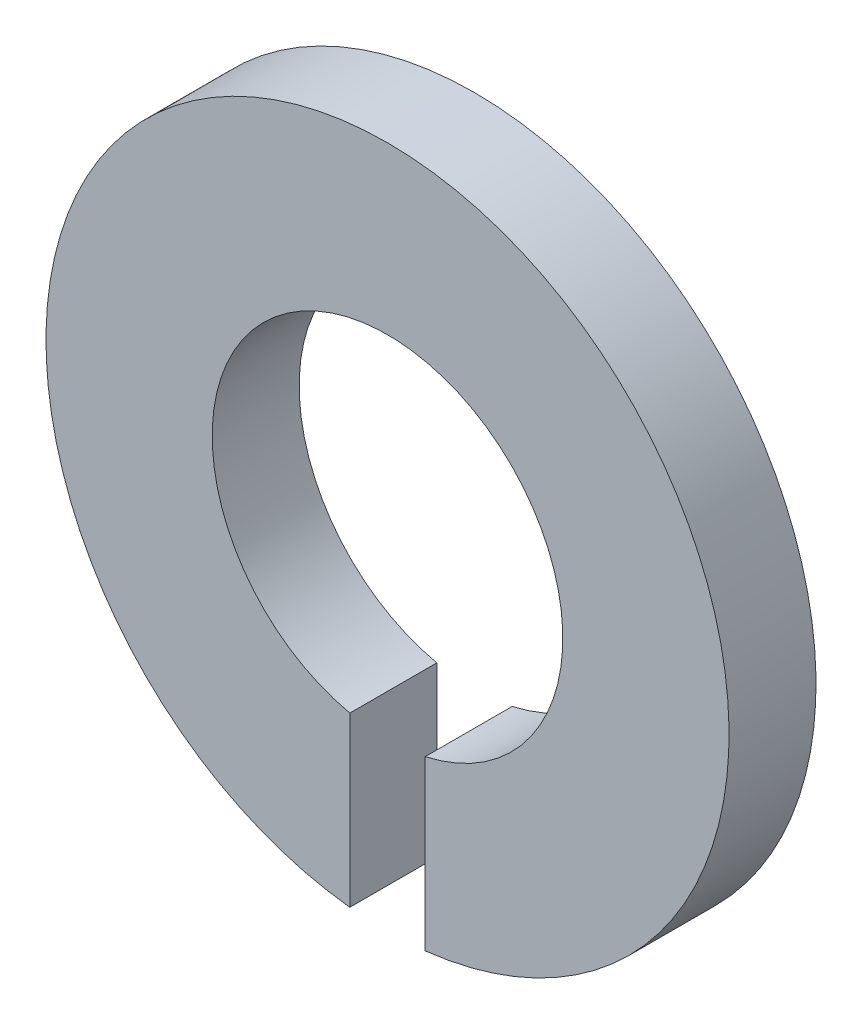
from build123d import *

# Parameters (mm, degrees)
EXTRUDE1_DEPTH = 1.5748


with BuildPart() as part:
    # Sketch1 → Extrude1 (new body)
    with BuildSketch(Plane.XY):
        with BuildLine():
            Line((-0.682826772, -3.100705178), (-0.682826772, -6.147091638))
            ThreePointArc((-0.682826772, -6.147091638), (0, 6.1849), (0.682826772, -6.147091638))
            Line((0.682826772, -6.147091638), (0.682826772, -3.100705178))
            ThreePointArc((0.682826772, -3.100705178), (0, 3.175), (-0.682826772, -3.100705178))
        make_face()
    extrude(amount=EXTRUDE1_DEPTH)


solid = part.part
